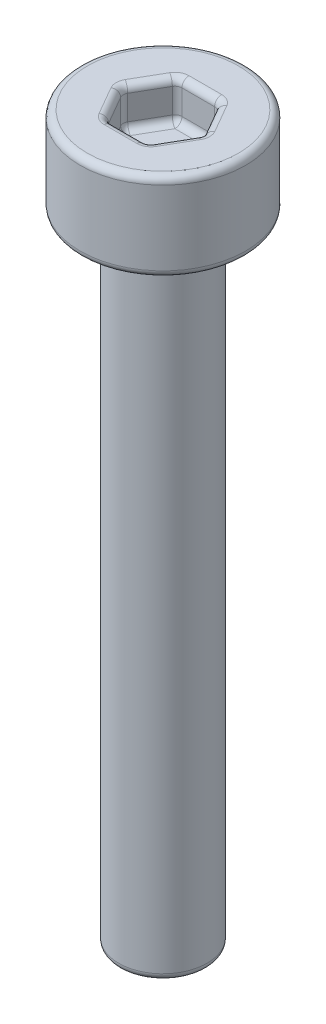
ISO-10303-21;
HEADER;
FILE_DESCRIPTION(('STEP AP214'),'2;1');
FILE_NAME('part.step','',(''),(''),'','','');
FILE_SCHEMA(('AUTOMOTIVE_DESIGN { 1 0 10303 214 1 1 1 1 }'));
ENDSEC;
DATA;
#1=APPLICATION_CONTEXT('core data for automotive mechanical design processes');
#2=APPLICATION_PROTOCOL_DEFINITION('international standard','automotive_design',2000,#1);
#3=PRODUCT_CONTEXT('',#1,'mechanical');
#4=PRODUCT('Part','Part','',(#3));
#5=PRODUCT_RELATED_PRODUCT_CATEGORY('part','',(#4));
#6=PRODUCT_DEFINITION_FORMATION('','',#4);
#7=PRODUCT_DEFINITION_CONTEXT('part definition',#1,'design');
#8=PRODUCT_DEFINITION('design','',#6,#7);
#9=PRODUCT_DEFINITION_SHAPE('','',#8);
#10=(LENGTH_UNIT() NAMED_UNIT(*) SI_UNIT(.MILLI.,.METRE.));
#11=(NAMED_UNIT(*) PLANE_ANGLE_UNIT() SI_UNIT($,.RADIAN.));
#12=(NAMED_UNIT(*) SI_UNIT($,.STERADIAN.) SOLID_ANGLE_UNIT());
#13=UNCERTAINTY_MEASURE_WITH_UNIT(LENGTH_MEASURE(1.E-05),#10,'distance_accuracy_value','');
#14=(GEOMETRIC_REPRESENTATION_CONTEXT(3) GLOBAL_UNCERTAINTY_ASSIGNED_CONTEXT((#13)) GLOBAL_UNIT_ASSIGNED_CONTEXT((#10,
#11,#12)) REPRESENTATION_CONTEXT('',''));
#15=CARTESIAN_POINT('',(0.,0.,0.));
#16=DIRECTION('',(0.,0.,1.));
#17=DIRECTION('',(1.,0.,0.));
#18=AXIS2_PLACEMENT_3D('',#15,#16,#17);
#19=CARTESIAN_POINT('',(0.,2.5,0.));
#20=DIRECTION('',(0.,1.,0.));
#21=DIRECTION('',(0.,0.,1.));
#22=AXIS2_PLACEMENT_3D('',#19,#20,#21);
#23=PLANE('',#22);
#24=CARTESIAN_POINT('',(0.,2.5,0.));
#25=DIRECTION('',(0.,1.,0.));
#26=DIRECTION('',(0.,0.,1.));
#27=AXIS2_PLACEMENT_3D('',#24,#25,#26);
#28=CIRCLE('',#27,2.14);
#29=CARTESIAN_POINT('',(0.,2.5,2.14));
#30=VERTEX_POINT('',#29);
#31=EDGE_CURVE('E243',#30,#30,#28,.T.);
#32=ORIENTED_EDGE('',*,*,#31,.T.);
#33=EDGE_LOOP('',(#32));
#34=FACE_BOUND('',#33,.T.);
#35=CARTESIAN_POINT('',(0.461880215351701,2.5,0.8));
#36=DIRECTION('',(0.,1.,0.));
#37=DIRECTION('',(0.,0.,1.));
#38=AXIS2_PLACEMENT_3D('',#35,#36,#37);
#39=CIRCLE('',#38,0.4);
#40=CARTESIAN_POINT('',(0.461880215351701,2.5,1.2));
#41=VERTEX_POINT('',#40);
#42=CARTESIAN_POINT('',(0.808290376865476,2.5,1.));
#43=VERTEX_POINT('',#42);
#44=EDGE_CURVE('E273',#41,#43,#39,.T.);
#45=ORIENTED_EDGE('',*,*,#44,.F.);
#46=DIRECTION('',(1.,0.,0.));
#47=VECTOR('',#46,1.);
#48=CARTESIAN_POINT('',(-0.577350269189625,2.5,1.2));
#49=LINE('',#48,#47);
#50=CARTESIAN_POINT('',(-0.461880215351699,2.5,1.2));
#51=VERTEX_POINT('',#50);
#52=EDGE_CURVE('E271',#41,#51,#49,.F.);
#53=ORIENTED_EDGE('',*,*,#52,.T.);
#54=CARTESIAN_POINT('',(-0.461880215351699,2.5,0.8));
#55=DIRECTION('',(0.,1.,0.));
#56=DIRECTION('',(0.,0.,1.));
#57=AXIS2_PLACEMENT_3D('',#54,#55,#56);
#58=CIRCLE('',#57,0.4);
#59=CARTESIAN_POINT('',(-0.808290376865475,2.5,1.));
#60=VERTEX_POINT('',#59);
#61=EDGE_CURVE('E268',#60,#51,#58,.T.);
#62=ORIENTED_EDGE('',*,*,#61,.F.);
#63=DIRECTION('',(0.5,0.,0.866025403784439));
#64=VECTOR('',#63,1.);
#65=CARTESIAN_POINT('',(-1.32790561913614,2.5,0.1));
#66=LINE('',#65,#64);
#67=CARTESIAN_POINT('',(-1.27017059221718,2.5,0.2));
#68=VERTEX_POINT('',#67);
#69=EDGE_CURVE('E260',#60,#68,#66,.F.);
#70=ORIENTED_EDGE('',*,*,#69,.T.);
#71=CARTESIAN_POINT('',(-0.9237604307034,2.5,0.));
#72=DIRECTION('',(0.,1.,0.));
#73=DIRECTION('',(0.,0.,1.));
#74=AXIS2_PLACEMENT_3D('',#71,#72,#73);
#75=CIRCLE('',#74,0.4);
#76=CARTESIAN_POINT('',(-1.27017059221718,2.5,-0.2));
#77=VERTEX_POINT('',#76);
#78=EDGE_CURVE('E258',#77,#68,#75,.T.);
#79=ORIENTED_EDGE('',*,*,#78,.F.);
#80=DIRECTION('',(-0.5,0.,0.866025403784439));
#81=VECTOR('',#80,1.);
#82=CARTESIAN_POINT('',(-0.750555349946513,2.5,-1.1));
#83=LINE('',#82,#81);
#84=CARTESIAN_POINT('',(-0.808290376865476,2.5,-1.));
#85=VERTEX_POINT('',#84);
#86=EDGE_CURVE('E254',#77,#85,#83,.F.);
#87=ORIENTED_EDGE('',*,*,#86,.T.);
#88=CARTESIAN_POINT('',(-0.4618802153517,2.5,-0.8));
#89=DIRECTION('',(0.,1.,0.));
#90=DIRECTION('',(0.,0.,1.));
#91=AXIS2_PLACEMENT_3D('',#88,#89,#90);
#92=CIRCLE('',#91,0.4);
#93=CARTESIAN_POINT('',(-0.4618802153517,2.5,-1.2));
#94=VERTEX_POINT('',#93);
#95=EDGE_CURVE('E251',#94,#85,#92,.T.);
#96=ORIENTED_EDGE('',*,*,#95,.F.);
#97=DIRECTION('',(-1.,0.,0.));
#98=VECTOR('',#97,1.);
#99=CARTESIAN_POINT('',(0.577350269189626,2.5,-1.2));
#100=LINE('',#99,#98);
#101=CARTESIAN_POINT('',(0.4618802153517,2.5,-1.2));
#102=VERTEX_POINT('',#101);
#103=EDGE_CURVE('E249',#94,#102,#100,.F.);
#104=ORIENTED_EDGE('',*,*,#103,.T.);
#105=CARTESIAN_POINT('',(0.4618802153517,2.5,-0.8));
#106=DIRECTION('',(0.,1.,0.));
#107=DIRECTION('',(0.,0.,1.));
#108=AXIS2_PLACEMENT_3D('',#105,#106,#107);
#109=CIRCLE('',#108,0.4);
#110=CARTESIAN_POINT('',(0.808290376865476,2.5,-1.));
#111=VERTEX_POINT('',#110);
#112=EDGE_CURVE('E246',#111,#102,#109,.T.);
#113=ORIENTED_EDGE('',*,*,#112,.F.);
#114=DIRECTION('',(-0.5,0.,-0.866025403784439));
#115=VECTOR('',#114,1.);
#116=CARTESIAN_POINT('',(1.32790561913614,2.5,-0.100000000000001));
#117=LINE('',#116,#115);
#118=CARTESIAN_POINT('',(1.27017059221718,2.5,-0.200000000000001));
#119=VERTEX_POINT('',#118);
#120=EDGE_CURVE('E256',#111,#119,#117,.F.);
#121=ORIENTED_EDGE('',*,*,#120,.T.);
#122=CARTESIAN_POINT('',(0.923760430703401,2.5,0.));
#123=DIRECTION('',(0.,1.,0.));
#124=DIRECTION('',(0.,0.,1.));
#125=AXIS2_PLACEMENT_3D('',#122,#123,#124);
#126=CIRCLE('',#125,0.4);
#127=CARTESIAN_POINT('',(1.27017059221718,2.5,0.199999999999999));
#128=VERTEX_POINT('',#127);
#129=EDGE_CURVE('E263',#128,#119,#126,.T.);
#130=ORIENTED_EDGE('',*,*,#129,.F.);
#131=DIRECTION('',(0.499999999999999,0.,-0.866025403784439));
#132=VECTOR('',#131,1.);
#133=CARTESIAN_POINT('',(0.750555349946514,2.5,1.1));
#134=LINE('',#133,#132);
#135=EDGE_CURVE('E266',#128,#43,#134,.F.);
#136=ORIENTED_EDGE('',*,*,#135,.T.);
#137=EDGE_LOOP('',(#45,#53,#62,#70,#79,#87,#96,#104,#113,#121,#130,#136));
#138=FACE_BOUND('',#137,.T.);
#139=ADVANCED_FACE('F43',(#34,#138),#23,.T.);
#140=CARTESIAN_POINT('',(0.,-18.,0.));
#141=DIRECTION('',(0.,1.,0.));
#142=DIRECTION('',(0.,0.,1.));
#143=AXIS2_PLACEMENT_3D('',#140,#141,#142);
#144=CYLINDRICAL_SURFACE('',#143,1.25);
#145=CARTESIAN_POINT('',(0.,-17.8,0.));
#146=DIRECTION('',(0.,1.,0.));
#147=DIRECTION('',(0.,0.,1.));
#148=AXIS2_PLACEMENT_3D('',#145,#146,#147);
#149=CIRCLE('',#148,1.25);
#150=CARTESIAN_POINT('',(0.,-17.8,1.25));
#151=VERTEX_POINT('',#150);
#152=EDGE_CURVE('E317',#151,#151,#149,.T.);
#153=ORIENTED_EDGE('',*,*,#152,.T.);
#154=EDGE_LOOP('',(#153));
#155=FACE_BOUND('',#154,.T.);
#156=CARTESIAN_POINT('',(0.,0.,0.));
#157=DIRECTION('',(0.,1.,0.));
#158=DIRECTION('',(0.,0.,1.));
#159=AXIS2_PLACEMENT_3D('',#156,#157,#158);
#160=CIRCLE('',#159,1.25);
#161=CARTESIAN_POINT('',(0.,0.,1.25));
#162=VERTEX_POINT('',#161);
#163=EDGE_CURVE('E222',#162,#162,#160,.T.);
#164=ORIENTED_EDGE('',*,*,#163,.F.);
#165=EDGE_LOOP('',(#164));
#166=FACE_BOUND('',#165,.T.);
#167=ADVANCED_FACE('F494',(#155,#166),#144,.T.);
#168=CARTESIAN_POINT('',(0.,-18.,0.));
#169=DIRECTION('',(0.,1.,0.));
#170=DIRECTION('',(0.,0.,1.));
#171=AXIS2_PLACEMENT_3D('',#168,#169,#170);
#172=PLANE('',#171);
#173=CARTESIAN_POINT('',(0.,-18.,0.));
#174=DIRECTION('',(0.,1.,0.));
#175=DIRECTION('',(0.,0.,1.));
#176=AXIS2_PLACEMENT_3D('',#173,#174,#175);
#177=CIRCLE('',#176,1.05);
#178=CARTESIAN_POINT('',(0.,-18.,1.05));
#179=VERTEX_POINT('',#178);
#180=EDGE_CURVE('E320',#179,#179,#177,.F.);
#181=ORIENTED_EDGE('',*,*,#180,.T.);
#182=EDGE_LOOP('',(#181));
#183=FACE_BOUND('',#182,.T.);
#184=ADVANCED_FACE('F500',(#183),#172,.F.);
#185=CARTESIAN_POINT('',(0.,2.5,0.));
#186=DIRECTION('',(0.,-1.,0.));
#187=DIRECTION('',(0.,0.,-1.));
#188=AXIS2_PLACEMENT_3D('',#185,#186,#187);
#189=CYLINDRICAL_SURFACE('',#188,2.34);
#190=CARTESIAN_POINT('',(0.,0.2,0.));
#191=DIRECTION('',(0.,1.,0.));
#192=DIRECTION('',(0.,0.,1.));
#193=AXIS2_PLACEMENT_3D('',#190,#191,#192);
#194=CIRCLE('',#193,2.34);
#195=CARTESIAN_POINT('',(0.,0.2,2.34));
#196=VERTEX_POINT('',#195);
#197=EDGE_CURVE('E52',#196,#196,#194,.T.);
#198=ORIENTED_EDGE('',*,*,#197,.T.);
#199=EDGE_LOOP('',(#198));
#200=FACE_BOUND('',#199,.T.);
#201=CARTESIAN_POINT('',(0.,2.3,0.));
#202=DIRECTION('',(0.,1.,0.));
#203=DIRECTION('',(0.,0.,1.));
#204=AXIS2_PLACEMENT_3D('',#201,#202,#203);
#205=CIRCLE('',#204,2.34);
#206=CARTESIAN_POINT('',(0.,2.3,2.34));
#207=VERTEX_POINT('',#206);
#208=EDGE_CURVE('E323',#207,#207,#205,.F.);
#209=ORIENTED_EDGE('',*,*,#208,.T.);
#210=EDGE_LOOP('',(#209));
#211=FACE_BOUND('',#210,.T.);
#212=ADVANCED_FACE('F509',(#200,#211),#189,.T.);
#213=CARTESIAN_POINT('',(0.,0.,0.));
#214=DIRECTION('',(0.,1.,0.));
#215=DIRECTION('',(0.,0.,1.));
#216=AXIS2_PLACEMENT_3D('',#213,#214,#215);
#217=PLANE('',#216);
#218=CARTESIAN_POINT('',(0.,0.,0.));
#219=DIRECTION('',(0.,1.,0.));
#220=DIRECTION('',(0.,0.,1.));
#221=AXIS2_PLACEMENT_3D('',#218,#219,#220);
#222=CIRCLE('',#221,2.14);
#223=CARTESIAN_POINT('',(0.,0.,2.14));
#224=VERTEX_POINT('',#223);
#225=EDGE_CURVE('E11',#224,#224,#222,.F.);
#226=ORIENTED_EDGE('',*,*,#225,.T.);
#227=EDGE_LOOP('',(#226));
#228=FACE_BOUND('',#227,.T.);
#229=ORIENTED_EDGE('',*,*,#163,.T.);
#230=EDGE_LOOP('',(#229));
#231=FACE_BOUND('',#230,.T.);
#232=ADVANCED_FACE('F506',(#228,#231),#217,.F.);
#233=CARTESIAN_POINT('',(0.577350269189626,1.4,1.));
#234=DIRECTION('',(0.866025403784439,0.,0.499999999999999));
#235=DIRECTION('',(0.499999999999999,0.,-0.866025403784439));
#236=AXIS2_PLACEMENT_3D('',#233,#234,#235);
#237=PLANE('',#236);
#238=DIRECTION('',(0.499999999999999,0.,-0.866025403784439));
#239=VECTOR('',#238,1.);
#240=CARTESIAN_POINT('',(0.577350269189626,1.6,1.));
#241=LINE('',#240,#239);
#242=CARTESIAN_POINT('',(1.09696551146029,1.6,0.0999999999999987));
#243=VERTEX_POINT('',#242);
#244=CARTESIAN_POINT('',(0.635085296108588,1.6,0.9));
#245=VERTEX_POINT('',#244);
#246=EDGE_CURVE('E289',#243,#245,#241,.F.);
#247=ORIENTED_EDGE('',*,*,#246,.T.);
#248=DIRECTION('',(0.,1.,0.));
#249=VECTOR('',#248,1.);
#250=CARTESIAN_POINT('',(0.635085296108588,2.5,0.9));
#251=LINE('',#250,#249);
#252=CARTESIAN_POINT('',(0.635085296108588,2.3,0.9));
#253=VERTEX_POINT('',#252);
#254=EDGE_CURVE('E291',#245,#253,#251,.T.);
#255=ORIENTED_EDGE('',*,*,#254,.T.);
#256=DIRECTION('',(0.499999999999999,0.,-0.866025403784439));
#257=VECTOR('',#256,1.);
#258=CARTESIAN_POINT('',(1.15470053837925,2.3,0.));
#259=LINE('',#258,#257);
#260=CARTESIAN_POINT('',(1.09696551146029,2.3,0.0999999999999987));
#261=VERTEX_POINT('',#260);
#262=EDGE_CURVE('E287',#253,#261,#259,.T.);
#263=ORIENTED_EDGE('',*,*,#262,.T.);
#264=DIRECTION('',(0.,1.,0.));
#265=VECTOR('',#264,1.);
#266=CARTESIAN_POINT('',(1.09696551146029,1.4,0.0999999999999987));
#267=LINE('',#266,#265);
#268=EDGE_CURVE('E285',#261,#243,#267,.F.);
#269=ORIENTED_EDGE('',*,*,#268,.T.);
#270=EDGE_LOOP('',(#247,#255,#263,#269));
#271=FACE_BOUND('',#270,.T.);
#272=ADVANCED_FACE('F505',(#271),#237,.F.);
#273=CARTESIAN_POINT('',(-0.577350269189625,1.4,1.));
#274=DIRECTION('',(0.,0.,1.));
#275=DIRECTION('',(1.,0.,0.));
#276=AXIS2_PLACEMENT_3D('',#273,#274,#275);
#277=PLANE('',#276);
#278=DIRECTION('',(1.,0.,0.));
#279=VECTOR('',#278,1.);
#280=CARTESIAN_POINT('',(-0.577350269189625,1.6,1.));
#281=LINE('',#280,#279);
#282=CARTESIAN_POINT('',(0.461880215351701,1.6,1.));
#283=VERTEX_POINT('',#282);
#284=CARTESIAN_POINT('',(-0.461880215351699,1.6,1.));
#285=VERTEX_POINT('',#284);
#286=EDGE_CURVE('E280',#283,#285,#281,.F.);
#287=ORIENTED_EDGE('',*,*,#286,.T.);
#288=DIRECTION('',(0.,1.,0.));
#289=VECTOR('',#288,1.);
#290=CARTESIAN_POINT('',(-0.461880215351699,2.5,1.));
#291=LINE('',#290,#289);
#292=CARTESIAN_POINT('',(-0.461880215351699,2.3,1.));
#293=VERTEX_POINT('',#292);
#294=EDGE_CURVE('E282',#285,#293,#291,.T.);
#295=ORIENTED_EDGE('',*,*,#294,.T.);
#296=DIRECTION('',(1.,0.,0.));
#297=VECTOR('',#296,1.);
#298=CARTESIAN_POINT('',(0.577350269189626,2.3,1.));
#299=LINE('',#298,#297);
#300=CARTESIAN_POINT('',(0.461880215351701,2.3,1.));
#301=VERTEX_POINT('',#300);
#302=EDGE_CURVE('E278',#293,#301,#299,.T.);
#303=ORIENTED_EDGE('',*,*,#302,.T.);
#304=DIRECTION('',(0.,1.,0.));
#305=VECTOR('',#304,1.);
#306=CARTESIAN_POINT('',(0.461880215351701,1.4,1.));
#307=LINE('',#306,#305);
#308=EDGE_CURVE('E276',#301,#283,#307,.F.);
#309=ORIENTED_EDGE('',*,*,#308,.T.);
#310=EDGE_LOOP('',(#287,#295,#303,#309));
#311=FACE_BOUND('',#310,.T.);
#312=ADVANCED_FACE('F850',(#311),#277,.F.);
#313=CARTESIAN_POINT('',(-1.15470053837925,1.4,0.));
#314=DIRECTION('',(-0.866025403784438,0.,0.5));
#315=DIRECTION('',(0.5,0.,0.866025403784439));
#316=AXIS2_PLACEMENT_3D('',#313,#314,#315);
#317=PLANE('',#316);
#318=DIRECTION('',(0.5,0.,0.866025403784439));
#319=VECTOR('',#318,1.);
#320=CARTESIAN_POINT('',(-0.577350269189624,2.3,1.));
#321=LINE('',#320,#319);
#322=CARTESIAN_POINT('',(-1.09696551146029,2.3,0.1));
#323=VERTEX_POINT('',#322);
#324=CARTESIAN_POINT('',(-0.635085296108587,2.3,0.9));
#325=VERTEX_POINT('',#324);
#326=EDGE_CURVE('E236',#323,#325,#321,.T.);
#327=ORIENTED_EDGE('',*,*,#326,.T.);
#328=DIRECTION('',(0.,1.,0.));
#329=VECTOR('',#328,1.);
#330=CARTESIAN_POINT('',(-0.635085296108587,1.4,0.9));
#331=LINE('',#330,#329);
#332=CARTESIAN_POINT('',(-0.635085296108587,1.6,0.9));
#333=VERTEX_POINT('',#332);
#334=EDGE_CURVE('E241',#325,#333,#331,.F.);
#335=ORIENTED_EDGE('',*,*,#334,.T.);
#336=DIRECTION('',(0.5,0.,0.866025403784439));
#337=VECTOR('',#336,1.);
#338=CARTESIAN_POINT('',(-1.15470053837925,1.6,0.));
#339=LINE('',#338,#337);
#340=CARTESIAN_POINT('',(-1.09696551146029,1.6,0.1));
#341=VERTEX_POINT('',#340);
#342=EDGE_CURVE('E238',#333,#341,#339,.F.);
#343=ORIENTED_EDGE('',*,*,#342,.T.);
#344=DIRECTION('',(0.,1.,0.));
#345=VECTOR('',#344,1.);
#346=CARTESIAN_POINT('',(-1.09696551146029,2.5,0.1));
#347=LINE('',#346,#345);
#348=EDGE_CURVE('E234',#341,#323,#347,.T.);
#349=ORIENTED_EDGE('',*,*,#348,.T.);
#350=EDGE_LOOP('',(#327,#335,#343,#349));
#351=FACE_BOUND('',#350,.T.);
#352=ADVANCED_FACE('F490',(#351),#317,.F.);
#353=CARTESIAN_POINT('',(-0.577350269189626,1.4,-1.));
#354=DIRECTION('',(-0.866025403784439,0.,-0.5));
#355=DIRECTION('',(-0.5,0.,0.866025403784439));
#356=AXIS2_PLACEMENT_3D('',#353,#354,#355);
#357=PLANE('',#356);
#358=DIRECTION('',(0.,1.,0.));
#359=VECTOR('',#358,1.);
#360=CARTESIAN_POINT('',(-1.09696551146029,1.4,-0.0999999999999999));
#361=LINE('',#360,#359);
#362=CARTESIAN_POINT('',(-1.09696551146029,2.3,-0.0999999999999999));
#363=VERTEX_POINT('',#362);
#364=CARTESIAN_POINT('',(-1.09696551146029,1.6,-0.0999999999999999));
#365=VERTEX_POINT('',#364);
#366=EDGE_CURVE('E306',#363,#365,#361,.F.);
#367=ORIENTED_EDGE('',*,*,#366,.T.);
#368=DIRECTION('',(-0.5,0.,0.866025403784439));
#369=VECTOR('',#368,1.);
#370=CARTESIAN_POINT('',(-0.577350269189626,1.6,-1.));
#371=LINE('',#370,#369);
#372=CARTESIAN_POINT('',(-0.635085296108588,1.6,-0.9));
#373=VERTEX_POINT('',#372);
#374=EDGE_CURVE('E308',#365,#373,#371,.F.);
#375=ORIENTED_EDGE('',*,*,#374,.T.);
#376=DIRECTION('',(0.,1.,0.));
#377=VECTOR('',#376,1.);
#378=CARTESIAN_POINT('',(-0.635085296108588,2.5,-0.9));
#379=LINE('',#378,#377);
#380=CARTESIAN_POINT('',(-0.635085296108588,2.3,-0.9));
#381=VERTEX_POINT('',#380);
#382=EDGE_CURVE('E302',#373,#381,#379,.T.);
#383=ORIENTED_EDGE('',*,*,#382,.T.);
#384=DIRECTION('',(-0.5,0.,0.866025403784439));
#385=VECTOR('',#384,1.);
#386=CARTESIAN_POINT('',(-1.15470053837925,2.3,0.));
#387=LINE('',#386,#385);
#388=EDGE_CURVE('E304',#381,#363,#387,.T.);
#389=ORIENTED_EDGE('',*,*,#388,.T.);
#390=EDGE_LOOP('',(#367,#375,#383,#389));
#391=FACE_BOUND('',#390,.T.);
#392=ADVANCED_FACE('F483',(#391),#357,.F.);
#393=CARTESIAN_POINT('',(0.577350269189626,1.4,-1.));
#394=DIRECTION('',(0.,0.,-1.));
#395=DIRECTION('',(-1.,0.,0.));
#396=AXIS2_PLACEMENT_3D('',#393,#394,#395);
#397=PLANE('',#396);
#398=DIRECTION('',(-1.,0.,0.));
#399=VECTOR('',#398,1.);
#400=CARTESIAN_POINT('',(0.577350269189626,1.6,-1.));
#401=LINE('',#400,#399);
#402=CARTESIAN_POINT('',(-0.4618802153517,1.6,-1.));
#403=VERTEX_POINT('',#402);
#404=CARTESIAN_POINT('',(0.4618802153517,1.6,-1.));
#405=VERTEX_POINT('',#404);
#406=EDGE_CURVE('E60',#403,#405,#401,.F.);
#407=ORIENTED_EDGE('',*,*,#406,.T.);
#408=DIRECTION('',(0.,1.,0.));
#409=VECTOR('',#408,1.);
#410=CARTESIAN_POINT('',(0.4618802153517,2.5,-1.));
#411=LINE('',#410,#409);
#412=CARTESIAN_POINT('',(0.4618802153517,2.3,-1.));
#413=VERTEX_POINT('',#412);
#414=EDGE_CURVE('E315',#405,#413,#411,.T.);
#415=ORIENTED_EDGE('',*,*,#414,.T.);
#416=DIRECTION('',(-1.,0.,0.));
#417=VECTOR('',#416,1.);
#418=CARTESIAN_POINT('',(-0.577350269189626,2.3,-1.));
#419=LINE('',#418,#417);
#420=CARTESIAN_POINT('',(-0.4618802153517,2.3,-1.));
#421=VERTEX_POINT('',#420);
#422=EDGE_CURVE('E311',#413,#421,#419,.T.);
#423=ORIENTED_EDGE('',*,*,#422,.T.);
#424=DIRECTION('',(0.,1.,0.));
#425=VECTOR('',#424,1.);
#426=CARTESIAN_POINT('',(-0.4618802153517,1.4,-1.));
#427=LINE('',#426,#425);
#428=EDGE_CURVE('E65',#421,#403,#427,.F.);
#429=ORIENTED_EDGE('',*,*,#428,.T.);
#430=EDGE_LOOP('',(#407,#415,#423,#429));
#431=FACE_BOUND('',#430,.T.);
#432=ADVANCED_FACE('F481',(#431),#397,.F.);
#433=CARTESIAN_POINT('',(1.15470053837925,1.4,0.));
#434=DIRECTION('',(0.866025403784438,0.,-0.5));
#435=DIRECTION('',(-0.5,0.,-0.866025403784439));
#436=AXIS2_PLACEMENT_3D('',#433,#434,#435);
#437=PLANE('',#436);
#438=DIRECTION('',(-0.5,0.,-0.866025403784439));
#439=VECTOR('',#438,1.);
#440=CARTESIAN_POINT('',(1.15470053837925,1.6,0.));
#441=LINE('',#440,#439);
#442=CARTESIAN_POINT('',(0.635085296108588,1.6,-0.9));
#443=VERTEX_POINT('',#442);
#444=CARTESIAN_POINT('',(1.09696551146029,1.6,-0.100000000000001));
#445=VERTEX_POINT('',#444);
#446=EDGE_CURVE('E204',#443,#445,#441,.F.);
#447=ORIENTED_EDGE('',*,*,#446,.T.);
#448=DIRECTION('',(0.,1.,0.));
#449=VECTOR('',#448,1.);
#450=CARTESIAN_POINT('',(1.09696551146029,2.5,-0.100000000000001));
#451=LINE('',#450,#449);
#452=CARTESIAN_POINT('',(1.09696551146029,2.3,-0.100000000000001));
#453=VERTEX_POINT('',#452);
#454=EDGE_CURVE('E299',#445,#453,#451,.T.);
#455=ORIENTED_EDGE('',*,*,#454,.T.);
#456=DIRECTION('',(-0.5,0.,-0.866025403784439));
#457=VECTOR('',#456,1.);
#458=CARTESIAN_POINT('',(0.577350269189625,2.3,-1.));
#459=LINE('',#458,#457);
#460=CARTESIAN_POINT('',(0.635085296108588,2.3,-0.9));
#461=VERTEX_POINT('',#460);
#462=EDGE_CURVE('E296',#453,#461,#459,.T.);
#463=ORIENTED_EDGE('',*,*,#462,.T.);
#464=DIRECTION('',(0.,1.,0.));
#465=VECTOR('',#464,1.);
#466=CARTESIAN_POINT('',(0.635085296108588,1.4,-0.9));
#467=LINE('',#466,#465);
#468=EDGE_CURVE('E294',#461,#443,#467,.F.);
#469=ORIENTED_EDGE('',*,*,#468,.T.);
#470=EDGE_LOOP('',(#447,#455,#463,#469));
#471=FACE_BOUND('',#470,.T.);
#472=ADVANCED_FACE('F478',(#471),#437,.F.);
#473=CARTESIAN_POINT('',(0.,1.4,0.));
#474=DIRECTION('',(0.,1.,0.));
#475=DIRECTION('',(0.,0.,1.));
#476=AXIS2_PLACEMENT_3D('',#473,#474,#475);
#477=PLANE('',#476);
#478=DIRECTION('',(-0.5,0.,0.866025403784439));
#479=VECTOR('',#478,1.);
#480=CARTESIAN_POINT('',(-0.692820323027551,1.4,-0.399999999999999));
#481=LINE('',#480,#479);
#482=CARTESIAN_POINT('',(-0.4618802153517,1.4,-0.8));
#483=VERTEX_POINT('',#482);
#484=CARTESIAN_POINT('',(-0.9237604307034,1.4,0.));
#485=VERTEX_POINT('',#484);
#486=EDGE_CURVE('E197',#483,#485,#481,.T.);
#487=ORIENTED_EDGE('',*,*,#486,.T.);
#488=DIRECTION('',(0.5,0.,0.866025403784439));
#489=VECTOR('',#488,1.);
#490=CARTESIAN_POINT('',(-0.69282032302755,1.4,0.4));
#491=LINE('',#490,#489);
#492=CARTESIAN_POINT('',(-0.461880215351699,1.4,0.8));
#493=VERTEX_POINT('',#492);
#494=EDGE_CURVE('E231',#485,#493,#491,.T.);
#495=ORIENTED_EDGE('',*,*,#494,.T.);
#496=DIRECTION('',(1.,0.,0.));
#497=VECTOR('',#496,1.);
#498=CARTESIAN_POINT('',(0.,1.4,0.8));
#499=LINE('',#498,#497);
#500=CARTESIAN_POINT('',(0.461880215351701,1.4,0.8));
#501=VERTEX_POINT('',#500);
#502=EDGE_CURVE('E229',#493,#501,#499,.T.);
#503=ORIENTED_EDGE('',*,*,#502,.T.);
#504=DIRECTION('',(0.499999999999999,0.,-0.866025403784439));
#505=VECTOR('',#504,1.);
#506=CARTESIAN_POINT('',(0.692820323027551,1.4,0.399999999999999));
#507=LINE('',#506,#505);
#508=CARTESIAN_POINT('',(0.923760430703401,1.4,0.));
#509=VERTEX_POINT('',#508);
#510=EDGE_CURVE('E193',#501,#509,#507,.T.);
#511=ORIENTED_EDGE('',*,*,#510,.T.);
#512=DIRECTION('',(-0.5,0.,-0.866025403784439));
#513=VECTOR('',#512,1.);
#514=CARTESIAN_POINT('',(0.692820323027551,1.4,-0.4));
#515=LINE('',#514,#513);
#516=CARTESIAN_POINT('',(0.4618802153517,1.4,-0.8));
#517=VERTEX_POINT('',#516);
#518=EDGE_CURVE('E186',#509,#517,#515,.T.);
#519=ORIENTED_EDGE('',*,*,#518,.T.);
#520=DIRECTION('',(-1.,0.,0.));
#521=VECTOR('',#520,1.);
#522=CARTESIAN_POINT('',(0.,1.4,-0.8));
#523=LINE('',#522,#521);
#524=EDGE_CURVE('E190',#517,#483,#523,.T.);
#525=ORIENTED_EDGE('',*,*,#524,.T.);
#526=EDGE_LOOP('',(#487,#495,#503,#511,#519,#525));
#527=FACE_BOUND('',#526,.T.);
#528=ADVANCED_FACE('F188',(#527),#477,.T.);
#529=CARTESIAN_POINT('',(1.32790561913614,2.3,-0.100000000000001));
#530=DIRECTION('',(0.5,0.,0.866025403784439));
#531=DIRECTION('',(0.866025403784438,0.,-0.5));
#532=AXIS2_PLACEMENT_3D('',#529,#530,#531);
#533=CYLINDRICAL_SURFACE('',#532,0.2);
#534=CARTESIAN_POINT('',(1.27017059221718,2.3,-0.200000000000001));
#535=DIRECTION('',(0.5,0.,0.866025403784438));
#536=DIRECTION('',(0.866025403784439,0.,-0.5));
#537=AXIS2_PLACEMENT_3D('',#534,#535,#536);
#538=CIRCLE('',#537,0.2);
#539=EDGE_CURVE('E409',#119,#453,#538,.T.);
#540=ORIENTED_EDGE('',*,*,#539,.F.);
#541=ORIENTED_EDGE('',*,*,#120,.F.);
#542=CARTESIAN_POINT('',(0.808290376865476,2.3,-1.));
#543=DIRECTION('',(-0.5,0.,-0.866025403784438));
#544=DIRECTION('',(-0.866025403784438,0.,0.5));
#545=AXIS2_PLACEMENT_3D('',#542,#543,#544);
#546=CIRCLE('',#545,0.2);
#547=EDGE_CURVE('E47',#461,#111,#546,.T.);
#548=ORIENTED_EDGE('',*,*,#547,.F.);
#549=ORIENTED_EDGE('',*,*,#462,.F.);
#550=EDGE_LOOP('',(#540,#541,#548,#549));
#551=FACE_BOUND('',#550,.T.);
#552=ADVANCED_FACE('F424',(#551),#533,.T.);
#553=CARTESIAN_POINT('',(0.4618802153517,2.3,-0.8));
#554=DIRECTION('',(0.,1.,0.));
#555=DIRECTION('',(0.,0.,1.));
#556=AXIS2_PLACEMENT_3D('',#553,#554,#555);
#557=TOROIDAL_SURFACE('',#556,0.4,0.2);
#558=ORIENTED_EDGE('',*,*,#547,.T.);
#559=ORIENTED_EDGE('',*,*,#112,.T.);
#560=CARTESIAN_POINT('',(0.4618802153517,2.3,-1.2));
#561=DIRECTION('',(1.,0.,0.));
#562=DIRECTION('',(0.,0.,-1.));
#563=AXIS2_PLACEMENT_3D('',#560,#561,#562);
#564=CIRCLE('',#563,0.2);
#565=EDGE_CURVE('E407',#413,#102,#564,.F.);
#566=ORIENTED_EDGE('',*,*,#565,.F.);
#567=CARTESIAN_POINT('',(0.4618802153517,2.3,-0.8));
#568=DIRECTION('',(0.,1.,0.));
#569=DIRECTION('',(0.,0.,1.));
#570=AXIS2_PLACEMENT_3D('',#567,#568,#569);
#571=CIRCLE('',#570,0.2);
#572=EDGE_CURVE('E404',#461,#413,#571,.T.);
#573=ORIENTED_EDGE('',*,*,#572,.F.);
#574=EDGE_LOOP('',(#558,#559,#566,#573));
#575=FACE_BOUND('',#574,.T.);
#576=ADVANCED_FACE('F419',(#575),#557,.T.);
#577=CARTESIAN_POINT('',(0.923760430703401,2.3,0.));
#578=DIRECTION('',(0.,1.,0.));
#579=DIRECTION('',(0.,0.,1.));
#580=AXIS2_PLACEMENT_3D('',#577,#578,#579);
#581=TOROIDAL_SURFACE('',#580,0.4,0.2);
#582=ORIENTED_EDGE('',*,*,#129,.T.);
#583=ORIENTED_EDGE('',*,*,#539,.T.);
#584=CARTESIAN_POINT('',(0.923760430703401,2.3,0.));
#585=DIRECTION('',(0.,1.,0.));
#586=DIRECTION('',(0.,0.,1.));
#587=AXIS2_PLACEMENT_3D('',#584,#585,#586);
#588=CIRCLE('',#587,0.2);
#589=EDGE_CURVE('E402',#261,#453,#588,.T.);
#590=ORIENTED_EDGE('',*,*,#589,.F.);
#591=CARTESIAN_POINT('',(1.27017059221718,2.3,0.199999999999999));
#592=DIRECTION('',(0.499999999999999,0.,-0.866025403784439));
#593=DIRECTION('',(-0.866025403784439,0.,-0.499999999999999));
#594=AXIS2_PLACEMENT_3D('',#591,#592,#593);
#595=CIRCLE('',#594,0.2);
#596=EDGE_CURVE('E399',#128,#261,#595,.F.);
#597=ORIENTED_EDGE('',*,*,#596,.F.);
#598=EDGE_LOOP('',(#582,#583,#590,#597));
#599=FACE_BOUND('',#598,.T.);
#600=ADVANCED_FACE('F594',(#599),#581,.T.);
#601=CARTESIAN_POINT('',(0.577350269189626,2.3,-1.2));
#602=DIRECTION('',(1.,0.,0.));
#603=DIRECTION('',(0.,0.,-1.));
#604=AXIS2_PLACEMENT_3D('',#601,#602,#603);
#605=CYLINDRICAL_SURFACE('',#604,0.2);
#606=ORIENTED_EDGE('',*,*,#565,.T.);
#607=ORIENTED_EDGE('',*,*,#103,.F.);
#608=CARTESIAN_POINT('',(-0.4618802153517,2.3,-1.2));
#609=DIRECTION('',(-1.,0.,0.));
#610=DIRECTION('',(0.,0.,1.));
#611=AXIS2_PLACEMENT_3D('',#608,#609,#610);
#612=CIRCLE('',#611,0.2);
#613=EDGE_CURVE('E396',#421,#94,#612,.T.);
#614=ORIENTED_EDGE('',*,*,#613,.F.);
#615=ORIENTED_EDGE('',*,*,#422,.F.);
#616=EDGE_LOOP('',(#606,#607,#614,#615));
#617=FACE_BOUND('',#616,.T.);
#618=ADVANCED_FACE('F430',(#617),#605,.T.);
#619=CARTESIAN_POINT('',(0.4618802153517,1.4,-0.8));
#620=DIRECTION('',(0.,-1.,0.));
#621=DIRECTION('',(0.,0.,-1.));
#622=AXIS2_PLACEMENT_3D('',#619,#620,#621);
#623=CYLINDRICAL_SURFACE('',#622,0.2);
#624=ORIENTED_EDGE('',*,*,#572,.T.);
#625=ORIENTED_EDGE('',*,*,#414,.F.);
#626=CARTESIAN_POINT('',(0.4618802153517,1.6,-0.8));
#627=DIRECTION('',(0.,1.,0.));
#628=DIRECTION('',(0.,0.,1.));
#629=AXIS2_PLACEMENT_3D('',#626,#627,#628);
#630=CIRCLE('',#629,0.2);
#631=EDGE_CURVE('E208',#443,#405,#630,.T.);
#632=ORIENTED_EDGE('',*,*,#631,.F.);
#633=ORIENTED_EDGE('',*,*,#468,.F.);
#634=EDGE_LOOP('',(#624,#625,#632,#633));
#635=FACE_BOUND('',#634,.T.);
#636=ADVANCED_FACE('F480',(#635),#623,.F.);
#637=CARTESIAN_POINT('',(0.692820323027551,1.6,-0.4));
#638=DIRECTION('',(-0.5,0.,-0.866025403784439));
#639=DIRECTION('',(-0.866025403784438,0.,0.5));
#640=AXIS2_PLACEMENT_3D('',#637,#638,#639);
#641=CYLINDRICAL_SURFACE('',#640,0.2);
#642=CARTESIAN_POINT('',(0.923760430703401,1.6,0.));
#643=DIRECTION('',(-0.5,0.,-0.866025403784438));
#644=DIRECTION('',(-0.866025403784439,0.,0.5));
#645=AXIS2_PLACEMENT_3D('',#642,#643,#644);
#646=CIRCLE('',#645,0.2);
#647=EDGE_CURVE('E209',#445,#509,#646,.T.);
#648=ORIENTED_EDGE('',*,*,#647,.F.);
#649=ORIENTED_EDGE('',*,*,#446,.F.);
#650=CARTESIAN_POINT('',(0.4618802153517,1.6,-0.8));
#651=DIRECTION('',(0.5,0.,0.866025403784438));
#652=DIRECTION('',(0.866025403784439,0.,-0.5));
#653=AXIS2_PLACEMENT_3D('',#650,#651,#652);
#654=CIRCLE('',#653,0.2);
#655=EDGE_CURVE('E201',#517,#443,#654,.T.);
#656=ORIENTED_EDGE('',*,*,#655,.F.);
#657=ORIENTED_EDGE('',*,*,#518,.F.);
#658=EDGE_LOOP('',(#648,#649,#656,#657));
#659=FACE_BOUND('',#658,.T.);
#660=ADVANCED_FACE('F203',(#659),#641,.F.);
#661=CARTESIAN_POINT('',(0.923760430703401,1.4,0.));
#662=DIRECTION('',(0.,-1.,0.));
#663=DIRECTION('',(0.,0.,-1.));
#664=AXIS2_PLACEMENT_3D('',#661,#662,#663);
#665=CYLINDRICAL_SURFACE('',#664,0.2);
#666=ORIENTED_EDGE('',*,*,#589,.T.);
#667=ORIENTED_EDGE('',*,*,#454,.F.);
#668=CARTESIAN_POINT('',(0.923760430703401,1.6,0.));
#669=DIRECTION('',(0.,1.,0.));
#670=DIRECTION('',(0.,0.,1.));
#671=AXIS2_PLACEMENT_3D('',#668,#669,#670);
#672=CIRCLE('',#671,0.2);
#673=EDGE_CURVE('E391',#243,#445,#672,.T.);
#674=ORIENTED_EDGE('',*,*,#673,.F.);
#675=ORIENTED_EDGE('',*,*,#268,.F.);
#676=EDGE_LOOP('',(#666,#667,#674,#675));
#677=FACE_BOUND('',#676,.T.);
#678=ADVANCED_FACE('F476',(#677),#665,.F.);
#679=CARTESIAN_POINT('',(0.750555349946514,2.3,1.1));
#680=DIRECTION('',(-0.499999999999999,0.,0.866025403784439));
#681=DIRECTION('',(0.866025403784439,0.,0.499999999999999));
#682=AXIS2_PLACEMENT_3D('',#679,#680,#681);
#683=CYLINDRICAL_SURFACE('',#682,0.2);
#684=ORIENTED_EDGE('',*,*,#596,.T.);
#685=ORIENTED_EDGE('',*,*,#262,.F.);
#686=CARTESIAN_POINT('',(0.808290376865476,2.3,1.));
#687=DIRECTION('',(-0.5,0.,0.866025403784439));
#688=DIRECTION('',(0.866025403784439,0.,0.5));
#689=AXIS2_PLACEMENT_3D('',#686,#687,#688);
#690=CIRCLE('',#689,0.2);
#691=EDGE_CURVE('E388',#43,#253,#690,.T.);
#692=ORIENTED_EDGE('',*,*,#691,.F.);
#693=ORIENTED_EDGE('',*,*,#135,.F.);
#694=EDGE_LOOP('',(#684,#685,#692,#693));
#695=FACE_BOUND('',#694,.T.);
#696=ADVANCED_FACE('F582',(#695),#683,.T.);
#697=CARTESIAN_POINT('',(-0.4618802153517,2.3,-0.8));
#698=DIRECTION('',(0.,1.,0.));
#699=DIRECTION('',(0.,0.,1.));
#700=AXIS2_PLACEMENT_3D('',#697,#698,#699);
#701=TOROIDAL_SURFACE('',#700,0.4,0.2);
#702=ORIENTED_EDGE('',*,*,#613,.T.);
#703=ORIENTED_EDGE('',*,*,#95,.T.);
#704=CARTESIAN_POINT('',(-0.808290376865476,2.3,-1.));
#705=DIRECTION('',(0.499999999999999,0.,-0.866025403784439));
#706=DIRECTION('',(-0.866025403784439,0.,-0.499999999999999));
#707=AXIS2_PLACEMENT_3D('',#704,#705,#706);
#708=CIRCLE('',#707,0.2);
#709=EDGE_CURVE('E385',#381,#85,#708,.F.);
#710=ORIENTED_EDGE('',*,*,#709,.F.);
#711=CARTESIAN_POINT('',(-0.4618802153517,2.3,-0.8));
#712=DIRECTION('',(0.,1.,0.));
#713=DIRECTION('',(0.,0.,1.));
#714=AXIS2_PLACEMENT_3D('',#711,#712,#713);
#715=CIRCLE('',#714,0.2);
#716=EDGE_CURVE('E215',#421,#381,#715,.T.);
#717=ORIENTED_EDGE('',*,*,#716,.F.);
#718=EDGE_LOOP('',(#702,#703,#710,#717));
#719=FACE_BOUND('',#718,.T.);
#720=ADVANCED_FACE('F433',(#719),#701,.T.);
#721=CARTESIAN_POINT('',(0.4618802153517,1.6,-0.8));
#722=DIRECTION('',(0.,0.,1.));
#723=DIRECTION('',(1.,0.,0.));
#724=AXIS2_PLACEMENT_3D('',#721,#722,#723);
#725=SPHERICAL_SURFACE('',#724,0.2);
#726=ORIENTED_EDGE('',*,*,#655,.T.);
#727=ORIENTED_EDGE('',*,*,#631,.T.);
#728=CARTESIAN_POINT('',(0.4618802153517,1.6,-0.8));
#729=DIRECTION('',(-1.,0.,0.));
#730=DIRECTION('',(0.,0.,1.));
#731=AXIS2_PLACEMENT_3D('',#728,#729,#730);
#732=CIRCLE('',#731,0.2);
#733=EDGE_CURVE('E212',#517,#405,#732,.F.);
#734=ORIENTED_EDGE('',*,*,#733,.F.);
#735=EDGE_LOOP('',(#726,#727,#734));
#736=FACE_BOUND('',#735,.T.);
#737=ADVANCED_FACE('F213',(#736),#725,.F.);
#738=CARTESIAN_POINT('',(0.923760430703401,1.6,0.));
#739=DIRECTION('',(0.,0.,1.));
#740=DIRECTION('',(1.,0.,0.));
#741=AXIS2_PLACEMENT_3D('',#738,#739,#740);
#742=SPHERICAL_SURFACE('',#741,0.2);
#743=ORIENTED_EDGE('',*,*,#673,.T.);
#744=ORIENTED_EDGE('',*,*,#647,.T.);
#745=CARTESIAN_POINT('',(0.923760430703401,1.6,0.));
#746=DIRECTION('',(-0.499999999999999,0.,0.866025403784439));
#747=DIRECTION('',(0.866025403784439,0.,0.499999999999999));
#748=AXIS2_PLACEMENT_3D('',#745,#746,#747);
#749=CIRCLE('',#748,0.2);
#750=EDGE_CURVE('E216',#243,#509,#749,.F.);
#751=ORIENTED_EDGE('',*,*,#750,.F.);
#752=EDGE_LOOP('',(#743,#744,#751));
#753=FACE_BOUND('',#752,.T.);
#754=ADVANCED_FACE('F471',(#753),#742,.F.);
#755=CARTESIAN_POINT('',(0.461880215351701,2.3,0.8));
#756=DIRECTION('',(0.,1.,0.));
#757=DIRECTION('',(0.,0.,1.));
#758=AXIS2_PLACEMENT_3D('',#755,#756,#757);
#759=TOROIDAL_SURFACE('',#758,0.4,0.2);
#760=ORIENTED_EDGE('',*,*,#44,.T.);
#761=ORIENTED_EDGE('',*,*,#691,.T.);
#762=CARTESIAN_POINT('',(0.461880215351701,2.3,0.8));
#763=DIRECTION('',(0.,1.,0.));
#764=DIRECTION('',(0.,0.,1.));
#765=AXIS2_PLACEMENT_3D('',#762,#763,#764);
#766=CIRCLE('',#765,0.2);
#767=EDGE_CURVE('E379',#301,#253,#766,.T.);
#768=ORIENTED_EDGE('',*,*,#767,.F.);
#769=CARTESIAN_POINT('',(0.461880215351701,2.3,1.2));
#770=DIRECTION('',(1.,0.,0.));
#771=DIRECTION('',(0.,0.,-1.));
#772=AXIS2_PLACEMENT_3D('',#769,#770,#771);
#773=CIRCLE('',#772,0.2);
#774=EDGE_CURVE('E376',#41,#301,#773,.F.);
#775=ORIENTED_EDGE('',*,*,#774,.F.);
#776=EDGE_LOOP('',(#760,#761,#768,#775));
#777=FACE_BOUND('',#776,.T.);
#778=ADVANCED_FACE('F571',(#777),#759,.T.);
#779=CARTESIAN_POINT('',(-0.750555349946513,2.3,-1.1));
#780=DIRECTION('',(0.5,0.,-0.866025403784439));
#781=DIRECTION('',(-0.866025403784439,0.,-0.5));
#782=AXIS2_PLACEMENT_3D('',#779,#780,#781);
#783=CYLINDRICAL_SURFACE('',#782,0.2);
#784=ORIENTED_EDGE('',*,*,#709,.T.);
#785=ORIENTED_EDGE('',*,*,#86,.F.);
#786=CARTESIAN_POINT('',(-1.27017059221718,2.3,-0.2));
#787=DIRECTION('',(-0.5,0.,0.866025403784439));
#788=DIRECTION('',(0.866025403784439,0.,0.5));
#789=AXIS2_PLACEMENT_3D('',#786,#787,#788);
#790=CIRCLE('',#789,0.2);
#791=EDGE_CURVE('E370',#363,#77,#790,.T.);
#792=ORIENTED_EDGE('',*,*,#791,.F.);
#793=ORIENTED_EDGE('',*,*,#388,.F.);
#794=EDGE_LOOP('',(#784,#785,#792,#793));
#795=FACE_BOUND('',#794,.T.);
#796=ADVANCED_FACE('F568',(#795),#783,.T.);
#797=CARTESIAN_POINT('',(-0.4618802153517,1.4,-0.8));
#798=DIRECTION('',(0.,-1.,0.));
#799=DIRECTION('',(0.,0.,-1.));
#800=AXIS2_PLACEMENT_3D('',#797,#798,#799);
#801=CYLINDRICAL_SURFACE('',#800,0.2);
#802=ORIENTED_EDGE('',*,*,#716,.T.);
#803=ORIENTED_EDGE('',*,*,#382,.F.);
#804=CARTESIAN_POINT('',(-0.4618802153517,1.6,-0.8));
#805=DIRECTION('',(0.,1.,0.));
#806=DIRECTION('',(0.,0.,1.));
#807=AXIS2_PLACEMENT_3D('',#804,#805,#806);
#808=CIRCLE('',#807,0.2);
#809=EDGE_CURVE('E367',#403,#373,#808,.T.);
#810=ORIENTED_EDGE('',*,*,#809,.F.);
#811=ORIENTED_EDGE('',*,*,#428,.F.);
#812=EDGE_LOOP('',(#802,#803,#810,#811));
#813=FACE_BOUND('',#812,.T.);
#814=ADVANCED_FACE('F439',(#813),#801,.F.);
#815=CARTESIAN_POINT('',(0.,1.6,-0.8));
#816=DIRECTION('',(-1.,0.,0.));
#817=DIRECTION('',(0.,0.,1.));
#818=AXIS2_PLACEMENT_3D('',#815,#816,#817);
#819=CYLINDRICAL_SURFACE('',#818,0.2);
#820=ORIENTED_EDGE('',*,*,#733,.T.);
#821=ORIENTED_EDGE('',*,*,#406,.F.);
#822=CARTESIAN_POINT('',(-0.4618802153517,1.6,-0.8));
#823=DIRECTION('',(1.,0.,0.));
#824=DIRECTION('',(0.,0.,-1.));
#825=AXIS2_PLACEMENT_3D('',#822,#823,#824);
#826=CIRCLE('',#825,0.2);
#827=EDGE_CURVE('E220',#483,#403,#826,.T.);
#828=ORIENTED_EDGE('',*,*,#827,.F.);
#829=ORIENTED_EDGE('',*,*,#524,.F.);
#830=EDGE_LOOP('',(#820,#821,#828,#829));
#831=FACE_BOUND('',#830,.T.);
#832=ADVANCED_FACE('F218',(#831),#819,.F.);
#833=CARTESIAN_POINT('',(0.692820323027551,1.6,0.399999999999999));
#834=DIRECTION('',(0.499999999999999,0.,-0.866025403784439));
#835=DIRECTION('',(-0.866025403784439,0.,-0.499999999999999));
#836=AXIS2_PLACEMENT_3D('',#833,#834,#835);
#837=CYLINDRICAL_SURFACE('',#836,0.2);
#838=ORIENTED_EDGE('',*,*,#750,.T.);
#839=ORIENTED_EDGE('',*,*,#510,.F.);
#840=CARTESIAN_POINT('',(0.461880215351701,1.6,0.8));
#841=DIRECTION('',(0.499999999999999,0.,-0.866025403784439));
#842=DIRECTION('',(-0.866025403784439,0.,-0.499999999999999));
#843=AXIS2_PLACEMENT_3D('',#840,#841,#842);
#844=CIRCLE('',#843,0.2);
#845=EDGE_CURVE('E363',#245,#501,#844,.T.);
#846=ORIENTED_EDGE('',*,*,#845,.F.);
#847=ORIENTED_EDGE('',*,*,#246,.F.);
#848=EDGE_LOOP('',(#838,#839,#846,#847));
#849=FACE_BOUND('',#848,.T.);
#850=ADVANCED_FACE('F468',(#849),#837,.F.);
#851=CARTESIAN_POINT('',(0.461880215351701,1.4,0.8));
#852=DIRECTION('',(0.,-1.,0.));
#853=DIRECTION('',(0.,0.,-1.));
#854=AXIS2_PLACEMENT_3D('',#851,#852,#853);
#855=CYLINDRICAL_SURFACE('',#854,0.2);
#856=ORIENTED_EDGE('',*,*,#767,.T.);
#857=ORIENTED_EDGE('',*,*,#254,.F.);
#858=CARTESIAN_POINT('',(0.461880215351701,1.6,0.8));
#859=DIRECTION('',(0.,1.,0.));
#860=DIRECTION('',(0.,0.,1.));
#861=AXIS2_PLACEMENT_3D('',#858,#859,#860);
#862=CIRCLE('',#861,0.2);
#863=EDGE_CURVE('E360',#283,#245,#862,.T.);
#864=ORIENTED_EDGE('',*,*,#863,.F.);
#865=ORIENTED_EDGE('',*,*,#308,.F.);
#866=EDGE_LOOP('',(#856,#857,#864,#865));
#867=FACE_BOUND('',#866,.T.);
#868=ADVANCED_FACE('F557',(#867),#855,.F.);
#869=CARTESIAN_POINT('',(-0.577350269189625,2.3,1.2));
#870=DIRECTION('',(-1.,0.,0.));
#871=DIRECTION('',(0.,0.,1.));
#872=AXIS2_PLACEMENT_3D('',#869,#870,#871);
#873=CYLINDRICAL_SURFACE('',#872,0.2);
#874=ORIENTED_EDGE('',*,*,#774,.T.);
#875=ORIENTED_EDGE('',*,*,#302,.F.);
#876=CARTESIAN_POINT('',(-0.461880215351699,2.3,1.2));
#877=DIRECTION('',(-1.,0.,0.));
#878=DIRECTION('',(0.,0.,1.));
#879=AXIS2_PLACEMENT_3D('',#876,#877,#878);
#880=CIRCLE('',#879,0.2);
#881=EDGE_CURVE('E357',#51,#293,#880,.T.);
#882=ORIENTED_EDGE('',*,*,#881,.F.);
#883=ORIENTED_EDGE('',*,*,#52,.F.);
#884=EDGE_LOOP('',(#874,#875,#882,#883));
#885=FACE_BOUND('',#884,.T.);
#886=ADVANCED_FACE('F553',(#885),#873,.T.);
#887=CARTESIAN_POINT('',(-1.32790561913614,2.3,0.1));
#888=DIRECTION('',(-0.5,0.,-0.866025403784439));
#889=DIRECTION('',(-0.866025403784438,0.,0.5));
#890=AXIS2_PLACEMENT_3D('',#887,#888,#889);
#891=CYLINDRICAL_SURFACE('',#890,0.2);
#892=CARTESIAN_POINT('',(-1.27017059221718,2.3,0.2));
#893=DIRECTION('',(-0.5,0.,-0.866025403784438));
#894=DIRECTION('',(-0.866025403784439,0.,0.5));
#895=AXIS2_PLACEMENT_3D('',#892,#893,#894);
#896=CIRCLE('',#895,0.2);
#897=EDGE_CURVE('E373',#68,#323,#896,.T.);
#898=ORIENTED_EDGE('',*,*,#897,.F.);
#899=ORIENTED_EDGE('',*,*,#69,.F.);
#900=CARTESIAN_POINT('',(-0.808290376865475,2.3,1.));
#901=DIRECTION('',(0.5,0.,0.866025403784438));
#902=DIRECTION('',(0.866025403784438,0.,-0.5));
#903=AXIS2_PLACEMENT_3D('',#900,#901,#902);
#904=CIRCLE('',#903,0.2);
#905=EDGE_CURVE('E354',#325,#60,#904,.T.);
#906=ORIENTED_EDGE('',*,*,#905,.F.);
#907=ORIENTED_EDGE('',*,*,#326,.F.);
#908=EDGE_LOOP('',(#898,#899,#906,#907));
#909=FACE_BOUND('',#908,.T.);
#910=ADVANCED_FACE('F549',(#909),#891,.T.);
#911=CARTESIAN_POINT('',(-0.9237604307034,2.3,0.));
#912=DIRECTION('',(0.,1.,0.));
#913=DIRECTION('',(0.,0.,1.));
#914=AXIS2_PLACEMENT_3D('',#911,#912,#913);
#915=TOROIDAL_SURFACE('',#914,0.4,0.2);
#916=ORIENTED_EDGE('',*,*,#78,.T.);
#917=ORIENTED_EDGE('',*,*,#897,.T.);
#918=CARTESIAN_POINT('',(-0.9237604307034,2.3,0.));
#919=DIRECTION('',(0.,1.,0.));
#920=DIRECTION('',(0.,0.,1.));
#921=AXIS2_PLACEMENT_3D('',#918,#919,#920);
#922=CIRCLE('',#921,0.2);
#923=EDGE_CURVE('E351',#363,#323,#922,.T.);
#924=ORIENTED_EDGE('',*,*,#923,.F.);
#925=ORIENTED_EDGE('',*,*,#791,.T.);
#926=EDGE_LOOP('',(#916,#917,#924,#925));
#927=FACE_BOUND('',#926,.T.);
#928=ADVANCED_FACE('F546',(#927),#915,.T.);
#929=CARTESIAN_POINT('',(-0.4618802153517,1.6,-0.8));
#930=DIRECTION('',(0.,0.,1.));
#931=DIRECTION('',(1.,0.,0.));
#932=AXIS2_PLACEMENT_3D('',#929,#930,#931);
#933=SPHERICAL_SURFACE('',#932,0.2);
#934=ORIENTED_EDGE('',*,*,#827,.T.);
#935=ORIENTED_EDGE('',*,*,#809,.T.);
#936=CARTESIAN_POINT('',(-0.4618802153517,1.6,-0.8));
#937=DIRECTION('',(-0.5,0.,0.866025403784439));
#938=DIRECTION('',(0.866025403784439,0.,0.5));
#939=AXIS2_PLACEMENT_3D('',#936,#937,#938);
#940=CIRCLE('',#939,0.2);
#941=EDGE_CURVE('E349',#483,#373,#940,.F.);
#942=ORIENTED_EDGE('',*,*,#941,.F.);
#943=EDGE_LOOP('',(#934,#935,#942));
#944=FACE_BOUND('',#943,.T.);
#945=ADVANCED_FACE('F441',(#944),#933,.F.);
#946=CARTESIAN_POINT('',(0.461880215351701,1.6,0.8));
#947=DIRECTION('',(0.,0.,1.));
#948=DIRECTION('',(1.,0.,0.));
#949=AXIS2_PLACEMENT_3D('',#946,#947,#948);
#950=SPHERICAL_SURFACE('',#949,0.2);
#951=ORIENTED_EDGE('',*,*,#863,.T.);
#952=ORIENTED_EDGE('',*,*,#845,.T.);
#953=CARTESIAN_POINT('',(0.461880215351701,1.6,0.8));
#954=DIRECTION('',(-1.,0.,0.));
#955=DIRECTION('',(0.,0.,1.));
#956=AXIS2_PLACEMENT_3D('',#953,#954,#955);
#957=CIRCLE('',#956,0.2);
#958=EDGE_CURVE('E346',#283,#501,#957,.F.);
#959=ORIENTED_EDGE('',*,*,#958,.F.);
#960=EDGE_LOOP('',(#951,#952,#959));
#961=FACE_BOUND('',#960,.T.);
#962=ADVANCED_FACE('F463',(#961),#950,.F.);
#963=CARTESIAN_POINT('',(-0.461880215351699,2.3,0.8));
#964=DIRECTION('',(0.,1.,0.));
#965=DIRECTION('',(0.,0.,1.));
#966=AXIS2_PLACEMENT_3D('',#963,#964,#965);
#967=TOROIDAL_SURFACE('',#966,0.4,0.2);
#968=ORIENTED_EDGE('',*,*,#61,.T.);
#969=ORIENTED_EDGE('',*,*,#881,.T.);
#970=CARTESIAN_POINT('',(-0.461880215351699,2.3,0.8));
#971=DIRECTION('',(0.,1.,0.));
#972=DIRECTION('',(0.,0.,1.));
#973=AXIS2_PLACEMENT_3D('',#970,#971,#972);
#974=CIRCLE('',#973,0.2);
#975=EDGE_CURVE('E344',#325,#293,#974,.T.);
#976=ORIENTED_EDGE('',*,*,#975,.F.);
#977=ORIENTED_EDGE('',*,*,#905,.T.);
#978=EDGE_LOOP('',(#968,#969,#976,#977));
#979=FACE_BOUND('',#978,.T.);
#980=ADVANCED_FACE('F537',(#979),#967,.T.);
#981=CARTESIAN_POINT('',(-0.9237604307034,1.4,0.));
#982=DIRECTION('',(0.,-1.,0.));
#983=DIRECTION('',(0.,0.,-1.));
#984=AXIS2_PLACEMENT_3D('',#981,#982,#983);
#985=CYLINDRICAL_SURFACE('',#984,0.2);
#986=ORIENTED_EDGE('',*,*,#923,.T.);
#987=ORIENTED_EDGE('',*,*,#348,.F.);
#988=CARTESIAN_POINT('',(-0.9237604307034,1.6,0.));
#989=DIRECTION('',(0.,1.,0.));
#990=DIRECTION('',(0.,0.,1.));
#991=AXIS2_PLACEMENT_3D('',#988,#989,#990);
#992=CIRCLE('',#991,0.2);
#993=EDGE_CURVE('E341',#365,#341,#992,.T.);
#994=ORIENTED_EDGE('',*,*,#993,.F.);
#995=ORIENTED_EDGE('',*,*,#366,.F.);
#996=EDGE_LOOP('',(#986,#987,#994,#995));
#997=FACE_BOUND('',#996,.T.);
#998=ADVANCED_FACE('F534',(#997),#985,.F.);
#999=CARTESIAN_POINT('',(-0.692820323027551,1.6,-0.399999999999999));
#1000=DIRECTION('',(-0.5,0.,0.866025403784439));
#1001=DIRECTION('',(0.866025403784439,0.,0.5));
#1002=AXIS2_PLACEMENT_3D('',#999,#1000,#1001);
#1003=CYLINDRICAL_SURFACE('',#1002,0.2);
#1004=ORIENTED_EDGE('',*,*,#941,.T.);
#1005=ORIENTED_EDGE('',*,*,#374,.F.);
#1006=CARTESIAN_POINT('',(-0.9237604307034,1.6,0.));
#1007=DIRECTION('',(0.5,0.,-0.866025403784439));
#1008=DIRECTION('',(-0.866025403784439,0.,-0.5));
#1009=AXIS2_PLACEMENT_3D('',#1006,#1007,#1008);
#1010=CIRCLE('',#1009,0.2);
#1011=EDGE_CURVE('E338',#485,#365,#1010,.T.);
#1012=ORIENTED_EDGE('',*,*,#1011,.F.);
#1013=ORIENTED_EDGE('',*,*,#486,.F.);
#1014=EDGE_LOOP('',(#1004,#1005,#1012,#1013));
#1015=FACE_BOUND('',#1014,.T.);
#1016=ADVANCED_FACE('F446',(#1015),#1003,.F.);
#1017=CARTESIAN_POINT('',(0.,1.6,0.8));
#1018=DIRECTION('',(1.,0.,0.));
#1019=DIRECTION('',(0.,0.,-1.));
#1020=AXIS2_PLACEMENT_3D('',#1017,#1018,#1019);
#1021=CYLINDRICAL_SURFACE('',#1020,0.2);
#1022=ORIENTED_EDGE('',*,*,#958,.T.);
#1023=ORIENTED_EDGE('',*,*,#502,.F.);
#1024=CARTESIAN_POINT('',(-0.461880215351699,1.6,0.8));
#1025=DIRECTION('',(1.,0.,0.));
#1026=DIRECTION('',(0.,0.,-1.));
#1027=AXIS2_PLACEMENT_3D('',#1024,#1025,#1026);
#1028=CIRCLE('',#1027,0.2);
#1029=EDGE_CURVE('E335',#285,#493,#1028,.T.);
#1030=ORIENTED_EDGE('',*,*,#1029,.F.);
#1031=ORIENTED_EDGE('',*,*,#286,.F.);
#1032=EDGE_LOOP('',(#1022,#1023,#1030,#1031));
#1033=FACE_BOUND('',#1032,.T.);
#1034=ADVANCED_FACE('F460',(#1033),#1021,.F.);
#1035=CARTESIAN_POINT('',(-0.461880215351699,1.4,0.8));
#1036=DIRECTION('',(0.,-1.,0.));
#1037=DIRECTION('',(0.,0.,-1.));
#1038=AXIS2_PLACEMENT_3D('',#1035,#1036,#1037);
#1039=CYLINDRICAL_SURFACE('',#1038,0.2);
#1040=ORIENTED_EDGE('',*,*,#975,.T.);
#1041=ORIENTED_EDGE('',*,*,#294,.F.);
#1042=CARTESIAN_POINT('',(-0.461880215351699,1.6,0.8));
#1043=DIRECTION('',(0.,1.,0.));
#1044=DIRECTION('',(0.,0.,1.));
#1045=AXIS2_PLACEMENT_3D('',#1042,#1043,#1044);
#1046=CIRCLE('',#1045,0.2);
#1047=EDGE_CURVE('E332',#333,#285,#1046,.T.);
#1048=ORIENTED_EDGE('',*,*,#1047,.F.);
#1049=ORIENTED_EDGE('',*,*,#334,.F.);
#1050=EDGE_LOOP('',(#1040,#1041,#1048,#1049));
#1051=FACE_BOUND('',#1050,.T.);
#1052=ADVANCED_FACE('F525',(#1051),#1039,.F.);
#1053=CARTESIAN_POINT('',(-0.9237604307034,1.6,0.));
#1054=DIRECTION('',(0.,0.,1.));
#1055=DIRECTION('',(1.,0.,0.));
#1056=AXIS2_PLACEMENT_3D('',#1053,#1054,#1055);
#1057=SPHERICAL_SURFACE('',#1056,0.2);
#1058=ORIENTED_EDGE('',*,*,#1011,.T.);
#1059=ORIENTED_EDGE('',*,*,#993,.T.);
#1060=CARTESIAN_POINT('',(-0.923760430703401,1.6,0.));
#1061=DIRECTION('',(0.5,0.,0.866025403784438));
#1062=DIRECTION('',(0.866025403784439,0.,-0.5));
#1063=AXIS2_PLACEMENT_3D('',#1060,#1061,#1062);
#1064=CIRCLE('',#1063,0.2);
#1065=EDGE_CURVE('E330',#485,#341,#1064,.F.);
#1066=ORIENTED_EDGE('',*,*,#1065,.F.);
#1067=EDGE_LOOP('',(#1058,#1059,#1066));
#1068=FACE_BOUND('',#1067,.T.);
#1069=ADVANCED_FACE('F522',(#1068),#1057,.F.);
#1070=CARTESIAN_POINT('',(-0.461880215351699,1.6,0.8));
#1071=DIRECTION('',(0.,0.,1.));
#1072=DIRECTION('',(1.,0.,0.));
#1073=AXIS2_PLACEMENT_3D('',#1070,#1071,#1072);
#1074=SPHERICAL_SURFACE('',#1073,0.2);
#1075=ORIENTED_EDGE('',*,*,#1047,.T.);
#1076=ORIENTED_EDGE('',*,*,#1029,.T.);
#1077=CARTESIAN_POINT('',(-0.461880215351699,1.6,0.8));
#1078=DIRECTION('',(-0.5,0.,-0.866025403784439));
#1079=DIRECTION('',(-0.866025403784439,0.,0.5));
#1080=AXIS2_PLACEMENT_3D('',#1077,#1078,#1079);
#1081=CIRCLE('',#1080,0.2);
#1082=EDGE_CURVE('E328',#333,#493,#1081,.F.);
#1083=ORIENTED_EDGE('',*,*,#1082,.F.);
#1084=EDGE_LOOP('',(#1075,#1076,#1083));
#1085=FACE_BOUND('',#1084,.T.);
#1086=ADVANCED_FACE('F456',(#1085),#1074,.F.);
#1087=CARTESIAN_POINT('',(-0.69282032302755,1.6,0.4));
#1088=DIRECTION('',(0.5,0.,0.866025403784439));
#1089=DIRECTION('',(0.866025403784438,0.,-0.5));
#1090=AXIS2_PLACEMENT_3D('',#1087,#1088,#1089);
#1091=CYLINDRICAL_SURFACE('',#1090,0.2);
#1092=ORIENTED_EDGE('',*,*,#1065,.T.);
#1093=ORIENTED_EDGE('',*,*,#342,.F.);
#1094=ORIENTED_EDGE('',*,*,#1082,.T.);
#1095=ORIENTED_EDGE('',*,*,#494,.F.);
#1096=EDGE_LOOP('',(#1092,#1093,#1094,#1095));
#1097=FACE_BOUND('',#1096,.T.);
#1098=ADVANCED_FACE('F451',(#1097),#1091,.F.);
#1099=CARTESIAN_POINT('',(0.,-17.8,0.));
#1100=DIRECTION('',(0.,1.,0.));
#1101=DIRECTION('',(0.,0.,1.));
#1102=AXIS2_PLACEMENT_3D('',#1099,#1100,#1101);
#1103=TOROIDAL_SURFACE('',#1102,1.05,0.2);
#1104=ORIENTED_EDGE('',*,*,#180,.F.);
#1105=EDGE_LOOP('',(#1104));
#1106=FACE_BOUND('',#1105,.T.);
#1107=ORIENTED_EDGE('',*,*,#152,.F.);
#1108=EDGE_LOOP('',(#1107));
#1109=FACE_BOUND('',#1108,.T.);
#1110=ADVANCED_FACE('F519',(#1106,#1109),#1103,.T.);
#1111=CARTESIAN_POINT('',(0.,0.2,0.));
#1112=DIRECTION('',(0.,1.,0.));
#1113=DIRECTION('',(0.,0.,1.));
#1114=AXIS2_PLACEMENT_3D('',#1111,#1112,#1113);
#1115=TOROIDAL_SURFACE('',#1114,2.14,0.2);
#1116=ORIENTED_EDGE('',*,*,#225,.F.);
#1117=EDGE_LOOP('',(#1116));
#1118=FACE_BOUND('',#1117,.T.);
#1119=ORIENTED_EDGE('',*,*,#197,.F.);
#1120=EDGE_LOOP('',(#1119));
#1121=FACE_BOUND('',#1120,.T.);
#1122=ADVANCED_FACE('F602',(#1118,#1121),#1115,.T.);
#1123=CARTESIAN_POINT('',(0.,2.3,0.));
#1124=DIRECTION('',(0.,1.,0.));
#1125=DIRECTION('',(0.,0.,1.));
#1126=AXIS2_PLACEMENT_3D('',#1123,#1124,#1125);
#1127=TOROIDAL_SURFACE('',#1126,2.14,0.2);
#1128=ORIENTED_EDGE('',*,*,#208,.F.);
#1129=EDGE_LOOP('',(#1128));
#1130=FACE_BOUND('',#1129,.T.);
#1131=ORIENTED_EDGE('',*,*,#31,.F.);
#1132=EDGE_LOOP('',(#1131));
#1133=FACE_BOUND('',#1132,.T.);
#1134=ADVANCED_FACE('F45',(#1130,#1133),#1127,.T.);
#1135=CLOSED_SHELL('',(#139,#167,#184,#212,#232,#272,#312,#352,#392,#432,#472,#528,#552,#576,
#600,#618,#636,#660,#678,#696,#720,#737,#754,#778,#796,#814,#832,#850,#868,#886,#910,#928,#945,
#962,#980,#998,#1016,#1034,#1052,#1069,#1086,#1098,#1110,#1122,#1134));
#1136=MANIFOLD_SOLID_BREP('B2',#1135);
#1137=ADVANCED_BREP_SHAPE_REPRESENTATION('',(#18,#1136),#14);
#1138=SHAPE_DEFINITION_REPRESENTATION(#9,#1137);
ENDSEC;
END-ISO-10303-21;
